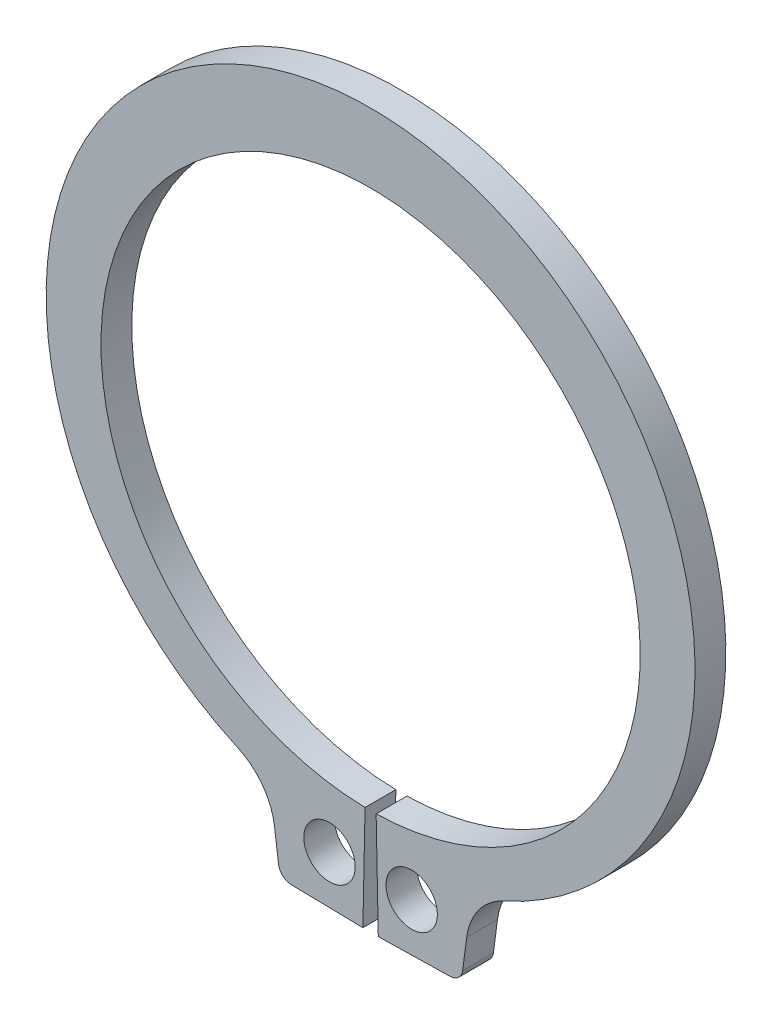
ISO-10303-21;
HEADER;
FILE_DESCRIPTION(('STEP AP214'),'2;1');
FILE_NAME('part.step','',(''),(''),'','','');
FILE_SCHEMA(('AUTOMOTIVE_DESIGN { 1 0 10303 214 1 1 1 1 }'));
ENDSEC;
DATA;
#1=APPLICATION_CONTEXT('core data for automotive mechanical design processes');
#2=APPLICATION_PROTOCOL_DEFINITION('international standard','automotive_design',2000,#1);
#3=PRODUCT_CONTEXT('',#1,'mechanical');
#4=PRODUCT('Part','Part','',(#3));
#5=PRODUCT_RELATED_PRODUCT_CATEGORY('part','',(#4));
#6=PRODUCT_DEFINITION_FORMATION('','',#4);
#7=PRODUCT_DEFINITION_CONTEXT('part definition',#1,'design');
#8=PRODUCT_DEFINITION('design','',#6,#7);
#9=PRODUCT_DEFINITION_SHAPE('','',#8);
#10=(LENGTH_UNIT() NAMED_UNIT(*) SI_UNIT(.MILLI.,.METRE.));
#11=(NAMED_UNIT(*) PLANE_ANGLE_UNIT() SI_UNIT($,.RADIAN.));
#12=(NAMED_UNIT(*) SI_UNIT($,.STERADIAN.) SOLID_ANGLE_UNIT());
#13=UNCERTAINTY_MEASURE_WITH_UNIT(LENGTH_MEASURE(1.E-05),#10,'distance_accuracy_value','');
#14=(GEOMETRIC_REPRESENTATION_CONTEXT(3) GLOBAL_UNCERTAINTY_ASSIGNED_CONTEXT((#13)) GLOBAL_UNIT_ASSIGNED_CONTEXT((#10,
#11,#12)) REPRESENTATION_CONTEXT('',''));
#15=CARTESIAN_POINT('',(0.,0.,0.));
#16=DIRECTION('',(0.,0.,1.));
#17=DIRECTION('',(1.,0.,0.));
#18=AXIS2_PLACEMENT_3D('',#15,#16,#17);
#19=CARTESIAN_POINT('',(0.,0.,-1.2));
#20=DIRECTION('',(0.,0.,1.));
#21=DIRECTION('',(1.,0.,0.));
#22=AXIS2_PLACEMENT_3D('',#19,#20,#21);
#23=CYLINDRICAL_SURFACE('',#22,10.5);
#24=CARTESIAN_POINT('',(0.,0.,0.));
#25=DIRECTION('',(0.,0.,-1.));
#26=DIRECTION('',(1.,0.,0.));
#27=AXIS2_PLACEMENT_3D('',#24,#25,#26);
#28=CIRCLE('',#27,10.5);
#29=CARTESIAN_POINT('',(-0.215753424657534,-10.4977831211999,0.));
#30=VERTEX_POINT('',#29);
#31=CARTESIAN_POINT('',(0.215753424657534,-10.4977831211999,0.));
#32=VERTEX_POINT('',#31);
#33=EDGE_CURVE('E151',#30,#32,#28,.T.);
#34=ORIENTED_EDGE('',*,*,#33,.F.);
#35=DIRECTION('',(0.,0.,1.));
#36=VECTOR('',#35,1.);
#37=CARTESIAN_POINT('',(-0.215753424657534,-10.4977831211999,-1.2));
#38=LINE('',#37,#36);
#39=CARTESIAN_POINT('',(-0.215753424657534,-10.4977831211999,-1.2));
#40=VERTEX_POINT('',#39);
#41=EDGE_CURVE('E11',#40,#30,#38,.T.);
#42=ORIENTED_EDGE('',*,*,#41,.F.);
#43=CARTESIAN_POINT('',(0.,0.,-1.2));
#44=DIRECTION('',(0.,0.,-1.));
#45=DIRECTION('',(1.,0.,0.));
#46=AXIS2_PLACEMENT_3D('',#43,#44,#45);
#47=CIRCLE('',#46,10.5);
#48=CARTESIAN_POINT('',(0.215753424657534,-10.4977831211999,-1.2));
#49=VERTEX_POINT('',#48);
#50=EDGE_CURVE('E184',#40,#49,#47,.T.);
#51=ORIENTED_EDGE('',*,*,#50,.T.);
#52=DIRECTION('',(0.,0.,1.));
#53=VECTOR('',#52,1.);
#54=CARTESIAN_POINT('',(0.215753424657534,-10.4977831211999,-1.2));
#55=LINE('',#54,#53);
#56=EDGE_CURVE('E33',#49,#32,#55,.T.);
#57=ORIENTED_EDGE('',*,*,#56,.T.);
#58=EDGE_LOOP('',(#34,#42,#51,#57));
#59=FACE_BOUND('',#58,.T.);
#60=ADVANCED_FACE('F30',(#59),#23,.F.);
#61=CARTESIAN_POINT('',(-0.215753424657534,-10.4977831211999,-1.2));
#62=DIRECTION('',(0.9997888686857,-0.0205479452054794,0.));
#63=DIRECTION('',(0.0205479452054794,0.9997888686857,0.));
#64=AXIS2_PLACEMENT_3D('',#61,#62,#63);
#65=PLANE('',#64);
#66=DIRECTION('',(0.0205479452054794,0.9997888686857,0.));
#67=VECTOR('',#66,1.);
#68=CARTESIAN_POINT('',(-0.215753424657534,-10.4977831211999,0.));
#69=LINE('',#68,#67);
#70=CARTESIAN_POINT('',(-0.3,-14.5969174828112,0.));
#71=VERTEX_POINT('',#70);
#72=EDGE_CURVE('E182',#71,#30,#69,.T.);
#73=ORIENTED_EDGE('',*,*,#72,.F.);
#74=DIRECTION('',(0.,0.,1.));
#75=VECTOR('',#74,1.);
#76=CARTESIAN_POINT('',(-0.3,-14.5969174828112,-1.2));
#77=LINE('',#76,#75);
#78=CARTESIAN_POINT('',(-0.3,-14.5969174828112,-1.2));
#79=VERTEX_POINT('',#78);
#80=EDGE_CURVE('E39',#79,#71,#77,.T.);
#81=ORIENTED_EDGE('',*,*,#80,.F.);
#82=DIRECTION('',(0.0205479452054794,0.9997888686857,0.));
#83=VECTOR('',#82,1.);
#84=CARTESIAN_POINT('',(-0.215753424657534,-10.4977831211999,-1.2));
#85=LINE('',#84,#83);
#86=EDGE_CURVE('E141',#79,#40,#85,.T.);
#87=ORIENTED_EDGE('',*,*,#86,.T.);
#88=ORIENTED_EDGE('',*,*,#41,.T.);
#89=EDGE_LOOP('',(#73,#81,#87,#88));
#90=FACE_BOUND('',#89,.T.);
#91=ADVANCED_FACE('F204',(#90),#65,.T.);
#92=CARTESIAN_POINT('',(-0.3,-14.5969174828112,-1.2));
#93=DIRECTION('',(-0.0205479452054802,-0.9997888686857,0.));
#94=DIRECTION('',(0.9997888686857,-0.0205479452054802,0.));
#95=AXIS2_PLACEMENT_3D('',#92,#93,#94);
#96=PLANE('',#95);
#97=DIRECTION('',(0.9997888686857,-0.0205479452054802,0.));
#98=VECTOR('',#97,1.);
#99=CARTESIAN_POINT('',(-0.3,-14.5969174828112,0.));
#100=LINE('',#99,#98);
#101=CARTESIAN_POINT('',(-3.09759495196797,-14.5394205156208,0.));
#102=VERTEX_POINT('',#101);
#103=EDGE_CURVE('E128',#102,#71,#100,.T.);
#104=ORIENTED_EDGE('',*,*,#103,.F.);
#105=DIRECTION('',(0.,0.,1.));
#106=VECTOR('',#105,1.);
#107=CARTESIAN_POINT('',(-3.09759495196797,-14.5394205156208,-1.2));
#108=LINE('',#107,#106);
#109=CARTESIAN_POINT('',(-3.09759495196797,-14.5394205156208,-1.2));
#110=VERTEX_POINT('',#109);
#111=EDGE_CURVE('E123',#110,#102,#108,.T.);
#112=ORIENTED_EDGE('',*,*,#111,.F.);
#113=DIRECTION('',(0.9997888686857,-0.0205479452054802,0.));
#114=VECTOR('',#113,1.);
#115=CARTESIAN_POINT('',(-0.3,-14.5969174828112,-1.2));
#116=LINE('',#115,#114);
#117=EDGE_CURVE('E126',#110,#79,#116,.T.);
#118=ORIENTED_EDGE('',*,*,#117,.T.);
#119=ORIENTED_EDGE('',*,*,#80,.T.);
#120=EDGE_LOOP('',(#104,#112,#118,#119));
#121=FACE_BOUND('',#120,.T.);
#122=ADVANCED_FACE('F125',(#121),#96,.T.);
#123=CARTESIAN_POINT('',(-3.08732097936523,-14.039526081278,-1.2));
#124=DIRECTION('',(0.,0.,1.));
#125=DIRECTION('',(1.,0.,0.));
#126=AXIS2_PLACEMENT_3D('',#123,#124,#125);
#127=CYLINDRICAL_SURFACE('',#126,0.5);
#128=CARTESIAN_POINT('',(-3.08732097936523,-14.039526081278,0.));
#129=DIRECTION('',(0.,0.,1.));
#130=DIRECTION('',(1.,0.,0.));
#131=AXIS2_PLACEMENT_3D('',#128,#129,#130);
#132=CIRCLE('',#131,0.5);
#133=CARTESIAN_POINT('',(-3.58304341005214,-14.104789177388,0.));
#134=VERTEX_POINT('',#133);
#135=EDGE_CURVE('E179',#134,#102,#132,.T.);
#136=ORIENTED_EDGE('',*,*,#135,.F.);
#137=DIRECTION('',(0.,0.,1.));
#138=VECTOR('',#137,1.);
#139=CARTESIAN_POINT('',(-3.58304341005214,-14.104789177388,-1.2));
#140=LINE('',#139,#138);
#141=CARTESIAN_POINT('',(-3.58304341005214,-14.104789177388,-1.2));
#142=VERTEX_POINT('',#141);
#143=EDGE_CURVE('E133',#142,#134,#140,.T.);
#144=ORIENTED_EDGE('',*,*,#143,.F.);
#145=CARTESIAN_POINT('',(-3.08732097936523,-14.039526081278,-1.2));
#146=DIRECTION('',(0.,0.,1.));
#147=DIRECTION('',(1.,0.,0.));
#148=AXIS2_PLACEMENT_3D('',#145,#146,#147);
#149=CIRCLE('',#148,0.5);
#150=EDGE_CURVE('E139',#142,#110,#149,.T.);
#151=ORIENTED_EDGE('',*,*,#150,.T.);
#152=ORIENTED_EDGE('',*,*,#111,.T.);
#153=EDGE_LOOP('',(#136,#144,#151,#152));
#154=FACE_BOUND('',#153,.T.);
#155=ADVANCED_FACE('F143',(#154),#127,.T.);
#156=CARTESIAN_POINT('',(-3.74243131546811,-12.894117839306,-1.2));
#157=DIRECTION('',(-0.99144486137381,-0.130526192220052,0.));
#158=DIRECTION('',(0.130526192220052,-0.99144486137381,0.));
#159=AXIS2_PLACEMENT_3D('',#156,#157,#158);
#160=PLANE('',#159);
#161=DIRECTION('',(0.130526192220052,-0.99144486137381,0.));
#162=VECTOR('',#161,1.);
#163=CARTESIAN_POINT('',(-3.74243131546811,-12.894117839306,0.));
#164=LINE('',#163,#162);
#165=CARTESIAN_POINT('',(-3.74243131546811,-12.894117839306,0.));
#166=VERTEX_POINT('',#165);
#167=EDGE_CURVE('E176',#166,#134,#164,.T.);
#168=ORIENTED_EDGE('',*,*,#167,.F.);
#169=DIRECTION('',(0.,0.,1.));
#170=VECTOR('',#169,1.);
#171=CARTESIAN_POINT('',(-3.74243131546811,-12.894117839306,-1.2));
#172=LINE('',#171,#170);
#173=CARTESIAN_POINT('',(-3.74243131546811,-12.894117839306,-1.2));
#174=VERTEX_POINT('',#173);
#175=EDGE_CURVE('E188',#174,#166,#172,.T.);
#176=ORIENTED_EDGE('',*,*,#175,.F.);
#177=DIRECTION('',(0.130526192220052,-0.99144486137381,0.));
#178=VECTOR('',#177,1.);
#179=CARTESIAN_POINT('',(-3.74243131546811,-12.894117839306,-1.2));
#180=LINE('',#179,#178);
#181=EDGE_CURVE('E144',#174,#142,#180,.T.);
#182=ORIENTED_EDGE('',*,*,#181,.T.);
#183=ORIENTED_EDGE('',*,*,#143,.T.);
#184=EDGE_LOOP('',(#168,#176,#182,#183));
#185=FACE_BOUND('',#184,.T.);
#186=ADVANCED_FACE('F217',(#185),#160,.T.);
#187=CARTESIAN_POINT('',(-6.20084298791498,-13.2177738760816,-1.2));
#188=DIRECTION('',(0.,0.,1.));
#189=DIRECTION('',(1.,0.,0.));
#190=AXIS2_PLACEMENT_3D('',#187,#188,#189);
#191=CYLINDRICAL_SURFACE('',#190,2.4796252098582);
#192=CARTESIAN_POINT('',(-6.20084298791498,-13.2177738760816,0.));
#193=DIRECTION('',(0.,0.,-1.));
#194=DIRECTION('',(1.,0.,0.));
#195=AXIS2_PLACEMENT_3D('',#192,#193,#194);
#196=CIRCLE('',#195,2.4796252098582);
#197=CARTESIAN_POINT('',(-5.18352298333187,-10.9564465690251,0.));
#198=VERTEX_POINT('',#197);
#199=EDGE_CURVE('E173',#198,#166,#196,.T.);
#200=ORIENTED_EDGE('',*,*,#199,.F.);
#201=DIRECTION('',(0.,0.,1.));
#202=VECTOR('',#201,1.);
#203=CARTESIAN_POINT('',(-5.18352298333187,-10.9564465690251,-1.2));
#204=LINE('',#203,#202);
#205=CARTESIAN_POINT('',(-5.18352298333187,-10.9564465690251,-1.2));
#206=VERTEX_POINT('',#205);
#207=EDGE_CURVE('E190',#206,#198,#204,.T.);
#208=ORIENTED_EDGE('',*,*,#207,.F.);
#209=CARTESIAN_POINT('',(-6.20084298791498,-13.2177738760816,-1.2));
#210=DIRECTION('',(0.,0.,-1.));
#211=DIRECTION('',(1.,0.,0.));
#212=AXIS2_PLACEMENT_3D('',#209,#210,#211);
#213=CIRCLE('',#212,2.4796252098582);
#214=EDGE_CURVE('E146',#206,#174,#213,.T.);
#215=ORIENTED_EDGE('',*,*,#214,.T.);
#216=ORIENTED_EDGE('',*,*,#175,.T.);
#217=EDGE_LOOP('',(#200,#208,#215,#216));
#218=FACE_BOUND('',#217,.T.);
#219=ADVANCED_FACE('F220',(#218),#191,.F.);
#220=CARTESIAN_POINT('',(0.,0.565633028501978,-1.2));
#221=DIRECTION('',(0.,0.,1.));
#222=DIRECTION('',(1.,0.,0.));
#223=AXIS2_PLACEMENT_3D('',#220,#221,#222);
#224=CYLINDRICAL_SURFACE('',#223,12.634366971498);
#225=CARTESIAN_POINT('',(0.,0.565633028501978,0.));
#226=DIRECTION('',(0.,0.,1.));
#227=DIRECTION('',(1.,0.,0.));
#228=AXIS2_PLACEMENT_3D('',#225,#226,#227);
#229=CIRCLE('',#228,12.634366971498);
#230=CARTESIAN_POINT('',(5.18352298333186,-10.9564465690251,0.));
#231=VERTEX_POINT('',#230);
#232=EDGE_CURVE('E170',#231,#198,#229,.T.);
#233=ORIENTED_EDGE('',*,*,#232,.F.);
#234=DIRECTION('',(0.,0.,1.));
#235=VECTOR('',#234,1.);
#236=CARTESIAN_POINT('',(5.18352298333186,-10.9564465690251,-1.2));
#237=LINE('',#236,#235);
#238=CARTESIAN_POINT('',(5.18352298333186,-10.9564465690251,-1.2));
#239=VERTEX_POINT('',#238);
#240=EDGE_CURVE('E192',#239,#231,#237,.T.);
#241=ORIENTED_EDGE('',*,*,#240,.F.);
#242=CARTESIAN_POINT('',(0.,0.565633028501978,-1.2));
#243=DIRECTION('',(0.,0.,1.));
#244=DIRECTION('',(1.,0.,0.));
#245=AXIS2_PLACEMENT_3D('',#242,#243,#244);
#246=CIRCLE('',#245,12.634366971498);
#247=EDGE_CURVE('E294',#239,#206,#246,.T.);
#248=ORIENTED_EDGE('',*,*,#247,.T.);
#249=ORIENTED_EDGE('',*,*,#207,.T.);
#250=EDGE_LOOP('',(#233,#241,#248,#249));
#251=FACE_BOUND('',#250,.T.);
#252=ADVANCED_FACE('F224',(#251),#224,.T.);
#253=CARTESIAN_POINT('',(6.20084298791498,-13.2177738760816,-1.2));
#254=DIRECTION('',(0.,0.,1.));
#255=DIRECTION('',(1.,0.,0.));
#256=AXIS2_PLACEMENT_3D('',#253,#254,#255);
#257=CYLINDRICAL_SURFACE('',#256,2.4796252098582);
#258=CARTESIAN_POINT('',(6.20084298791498,-13.2177738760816,0.));
#259=DIRECTION('',(0.,0.,-1.));
#260=DIRECTION('',(1.,0.,0.));
#261=AXIS2_PLACEMENT_3D('',#258,#259,#260);
#262=CIRCLE('',#261,2.4796252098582);
#263=CARTESIAN_POINT('',(3.74243131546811,-12.894117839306,0.));
#264=VERTEX_POINT('',#263);
#265=EDGE_CURVE('E167',#264,#231,#262,.T.);
#266=ORIENTED_EDGE('',*,*,#265,.F.);
#267=DIRECTION('',(0.,0.,1.));
#268=VECTOR('',#267,1.);
#269=CARTESIAN_POINT('',(3.74243131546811,-12.894117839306,-1.2));
#270=LINE('',#269,#268);
#271=CARTESIAN_POINT('',(3.74243131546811,-12.894117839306,-1.2));
#272=VERTEX_POINT('',#271);
#273=EDGE_CURVE('E194',#272,#264,#270,.T.);
#274=ORIENTED_EDGE('',*,*,#273,.F.);
#275=CARTESIAN_POINT('',(6.20084298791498,-13.2177738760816,-1.2));
#276=DIRECTION('',(0.,0.,-1.));
#277=DIRECTION('',(1.,0.,0.));
#278=AXIS2_PLACEMENT_3D('',#275,#276,#277);
#279=CIRCLE('',#278,2.4796252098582);
#280=EDGE_CURVE('E291',#272,#239,#279,.T.);
#281=ORIENTED_EDGE('',*,*,#280,.T.);
#282=ORIENTED_EDGE('',*,*,#240,.T.);
#283=EDGE_LOOP('',(#266,#274,#281,#282));
#284=FACE_BOUND('',#283,.T.);
#285=ADVANCED_FACE('F228',(#284),#257,.F.);
#286=CARTESIAN_POINT('',(3.74243131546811,-12.894117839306,-1.2));
#287=DIRECTION('',(0.99144486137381,-0.130526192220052,0.));
#288=DIRECTION('',(0.130526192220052,0.99144486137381,0.));
#289=AXIS2_PLACEMENT_3D('',#286,#287,#288);
#290=PLANE('',#289);
#291=DIRECTION('',(0.130526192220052,0.99144486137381,0.));
#292=VECTOR('',#291,1.);
#293=CARTESIAN_POINT('',(3.74243131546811,-12.894117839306,0.));
#294=LINE('',#293,#292);
#295=CARTESIAN_POINT('',(3.58304341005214,-14.104789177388,0.));
#296=VERTEX_POINT('',#295);
#297=EDGE_CURVE('E164',#296,#264,#294,.T.);
#298=ORIENTED_EDGE('',*,*,#297,.F.);
#299=DIRECTION('',(0.,0.,1.));
#300=VECTOR('',#299,1.);
#301=CARTESIAN_POINT('',(3.58304341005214,-14.104789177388,-1.2));
#302=LINE('',#301,#300);
#303=CARTESIAN_POINT('',(3.58304341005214,-14.104789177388,-1.2));
#304=VERTEX_POINT('',#303);
#305=EDGE_CURVE('E196',#304,#296,#302,.T.);
#306=ORIENTED_EDGE('',*,*,#305,.F.);
#307=DIRECTION('',(0.130526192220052,0.99144486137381,0.));
#308=VECTOR('',#307,1.);
#309=CARTESIAN_POINT('',(3.74243131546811,-12.894117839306,-1.2));
#310=LINE('',#309,#308);
#311=EDGE_CURVE('E288',#304,#272,#310,.T.);
#312=ORIENTED_EDGE('',*,*,#311,.T.);
#313=ORIENTED_EDGE('',*,*,#273,.T.);
#314=EDGE_LOOP('',(#298,#306,#312,#313));
#315=FACE_BOUND('',#314,.T.);
#316=ADVANCED_FACE('F232',(#315),#290,.T.);
#317=CARTESIAN_POINT('',(3.08732097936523,-14.039526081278,-1.2));
#318=DIRECTION('',(0.,0.,1.));
#319=DIRECTION('',(1.,0.,0.));
#320=AXIS2_PLACEMENT_3D('',#317,#318,#319);
#321=CYLINDRICAL_SURFACE('',#320,0.5);
#322=CARTESIAN_POINT('',(3.08732097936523,-14.039526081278,0.));
#323=DIRECTION('',(0.,0.,1.));
#324=DIRECTION('',(-1.,0.,0.));
#325=AXIS2_PLACEMENT_3D('',#322,#323,#324);
#326=CIRCLE('',#325,0.5);
#327=CARTESIAN_POINT('',(3.09759495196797,-14.5394205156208,0.));
#328=VERTEX_POINT('',#327);
#329=EDGE_CURVE('E161',#328,#296,#326,.T.);
#330=ORIENTED_EDGE('',*,*,#329,.F.);
#331=DIRECTION('',(0.,0.,1.));
#332=VECTOR('',#331,1.);
#333=CARTESIAN_POINT('',(3.09759495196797,-14.5394205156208,-1.2));
#334=LINE('',#333,#332);
#335=CARTESIAN_POINT('',(3.09759495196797,-14.5394205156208,-1.2));
#336=VERTEX_POINT('',#335);
#337=EDGE_CURVE('E198',#336,#328,#334,.T.);
#338=ORIENTED_EDGE('',*,*,#337,.F.);
#339=CARTESIAN_POINT('',(3.08732097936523,-14.039526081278,-1.2));
#340=DIRECTION('',(0.,0.,1.));
#341=DIRECTION('',(-1.,0.,0.));
#342=AXIS2_PLACEMENT_3D('',#339,#340,#341);
#343=CIRCLE('',#342,0.5);
#344=EDGE_CURVE('E285',#336,#304,#343,.T.);
#345=ORIENTED_EDGE('',*,*,#344,.T.);
#346=ORIENTED_EDGE('',*,*,#305,.T.);
#347=EDGE_LOOP('',(#330,#338,#345,#346));
#348=FACE_BOUND('',#347,.T.);
#349=ADVANCED_FACE('F236',(#348),#321,.T.);
#350=CARTESIAN_POINT('',(0.3,-14.5969174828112,-1.2));
#351=DIRECTION('',(0.0205479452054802,-0.9997888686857,0.));
#352=DIRECTION('',(0.9997888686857,0.0205479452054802,0.));
#353=AXIS2_PLACEMENT_3D('',#350,#351,#352);
#354=PLANE('',#353);
#355=DIRECTION('',(0.9997888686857,0.0205479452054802,0.));
#356=VECTOR('',#355,1.);
#357=CARTESIAN_POINT('',(0.3,-14.5969174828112,0.));
#358=LINE('',#357,#356);
#359=CARTESIAN_POINT('',(0.3,-14.5969174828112,0.));
#360=VERTEX_POINT('',#359);
#361=EDGE_CURVE('E158',#360,#328,#358,.T.);
#362=ORIENTED_EDGE('',*,*,#361,.F.);
#363=DIRECTION('',(0.,0.,1.));
#364=VECTOR('',#363,1.);
#365=CARTESIAN_POINT('',(0.3,-14.5969174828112,-1.2));
#366=LINE('',#365,#364);
#367=CARTESIAN_POINT('',(0.3,-14.5969174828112,-1.2));
#368=VERTEX_POINT('',#367);
#369=EDGE_CURVE('E199',#368,#360,#366,.T.);
#370=ORIENTED_EDGE('',*,*,#369,.F.);
#371=DIRECTION('',(0.9997888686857,0.0205479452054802,0.));
#372=VECTOR('',#371,1.);
#373=CARTESIAN_POINT('',(0.3,-14.5969174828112,-1.2));
#374=LINE('',#373,#372);
#375=EDGE_CURVE('E282',#368,#336,#374,.T.);
#376=ORIENTED_EDGE('',*,*,#375,.T.);
#377=ORIENTED_EDGE('',*,*,#337,.T.);
#378=EDGE_LOOP('',(#362,#370,#376,#377));
#379=FACE_BOUND('',#378,.T.);
#380=ADVANCED_FACE('F240',(#379),#354,.T.);
#381=CARTESIAN_POINT('',(0.215753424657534,-10.4977831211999,-1.2));
#382=DIRECTION('',(-0.9997888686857,-0.0205479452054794,0.));
#383=DIRECTION('',(0.0205479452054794,-0.9997888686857,0.));
#384=AXIS2_PLACEMENT_3D('',#381,#382,#383);
#385=PLANE('',#384);
#386=DIRECTION('',(0.0205479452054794,-0.9997888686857,0.));
#387=VECTOR('',#386,1.);
#388=CARTESIAN_POINT('',(0.215753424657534,-10.4977831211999,0.));
#389=LINE('',#388,#387);
#390=EDGE_CURVE('E154',#32,#360,#389,.T.);
#391=ORIENTED_EDGE('',*,*,#390,.F.);
#392=ORIENTED_EDGE('',*,*,#56,.F.);
#393=DIRECTION('',(0.0205479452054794,-0.9997888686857,0.));
#394=VECTOR('',#393,1.);
#395=CARTESIAN_POINT('',(0.215753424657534,-10.4977831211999,-1.2));
#396=LINE('',#395,#394);
#397=EDGE_CURVE('E280',#49,#368,#396,.T.);
#398=ORIENTED_EDGE('',*,*,#397,.T.);
#399=ORIENTED_EDGE('',*,*,#369,.T.);
#400=EDGE_LOOP('',(#391,#392,#398,#399));
#401=FACE_BOUND('',#400,.T.);
#402=ADVANCED_FACE('F201',(#401),#385,.T.);
#403=CARTESIAN_POINT('',(0.,0.,-1.2));
#404=DIRECTION('',(0.,0.,1.));
#405=DIRECTION('',(1.,0.,0.));
#406=AXIS2_PLACEMENT_3D('',#403,#404,#405);
#407=PLANE('',#406);
#408=CARTESIAN_POINT('',(-1.6,-12.69960629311,-1.2));
#409=DIRECTION('',(0.,0.,1.));
#410=DIRECTION('',(1.,0.,0.));
#411=AXIS2_PLACEMENT_3D('',#408,#409,#410);
#412=CIRCLE('',#411,1.);
#413=CARTESIAN_POINT('',(-0.6,-12.69960629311,-1.2));
#414=VERTEX_POINT('',#413);
#415=EDGE_CURVE('E267',#414,#414,#412,.T.);
#416=ORIENTED_EDGE('',*,*,#415,.T.);
#417=EDGE_LOOP('',(#416));
#418=FACE_BOUND('',#417,.T.);
#419=CARTESIAN_POINT('',(1.6,-12.69960629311,-1.2));
#420=DIRECTION('',(0.,0.,1.));
#421=DIRECTION('',(1.,0.,0.));
#422=AXIS2_PLACEMENT_3D('',#419,#420,#421);
#423=CIRCLE('',#422,1.);
#424=CARTESIAN_POINT('',(2.6,-12.69960629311,-1.2));
#425=VERTEX_POINT('',#424);
#426=EDGE_CURVE('E155',#425,#425,#423,.T.);
#427=ORIENTED_EDGE('',*,*,#426,.T.);
#428=EDGE_LOOP('',(#427));
#429=FACE_BOUND('',#428,.T.);
#430=ORIENTED_EDGE('',*,*,#50,.F.);
#431=ORIENTED_EDGE('',*,*,#86,.F.);
#432=ORIENTED_EDGE('',*,*,#117,.F.);
#433=ORIENTED_EDGE('',*,*,#150,.F.);
#434=ORIENTED_EDGE('',*,*,#181,.F.);
#435=ORIENTED_EDGE('',*,*,#214,.F.);
#436=ORIENTED_EDGE('',*,*,#247,.F.);
#437=ORIENTED_EDGE('',*,*,#280,.F.);
#438=ORIENTED_EDGE('',*,*,#311,.F.);
#439=ORIENTED_EDGE('',*,*,#344,.F.);
#440=ORIENTED_EDGE('',*,*,#375,.F.);
#441=ORIENTED_EDGE('',*,*,#397,.F.);
#442=EDGE_LOOP('',(#430,#431,#432,#433,#434,#435,#436,#437,#438,#439,#440,#441));
#443=FACE_BOUND('',#442,.T.);
#444=ADVANCED_FACE('F137',(#418,#429,#443),#407,.F.);
#445=CARTESIAN_POINT('',(0.,0.,0.));
#446=DIRECTION('',(0.,0.,1.));
#447=DIRECTION('',(1.,0.,0.));
#448=AXIS2_PLACEMENT_3D('',#445,#446,#447);
#449=PLANE('',#448);
#450=CARTESIAN_POINT('',(-1.6,-12.69960629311,0.));
#451=DIRECTION('',(0.,0.,1.));
#452=DIRECTION('',(1.,0.,0.));
#453=AXIS2_PLACEMENT_3D('',#450,#451,#452);
#454=CIRCLE('',#453,1.);
#455=CARTESIAN_POINT('',(-0.6,-12.69960629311,0.));
#456=VERTEX_POINT('',#455);
#457=EDGE_CURVE('E270',#456,#456,#454,.T.);
#458=ORIENTED_EDGE('',*,*,#457,.F.);
#459=EDGE_LOOP('',(#458));
#460=FACE_BOUND('',#459,.T.);
#461=CARTESIAN_POINT('',(1.6,-12.69960629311,0.));
#462=DIRECTION('',(0.,0.,1.));
#463=DIRECTION('',(1.,0.,0.));
#464=AXIS2_PLACEMENT_3D('',#461,#462,#463);
#465=CIRCLE('',#464,1.);
#466=CARTESIAN_POINT('',(2.6,-12.69960629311,0.));
#467=VERTEX_POINT('',#466);
#468=EDGE_CURVE('E272',#467,#467,#465,.T.);
#469=ORIENTED_EDGE('',*,*,#468,.F.);
#470=EDGE_LOOP('',(#469));
#471=FACE_BOUND('',#470,.T.);
#472=ORIENTED_EDGE('',*,*,#33,.T.);
#473=ORIENTED_EDGE('',*,*,#390,.T.);
#474=ORIENTED_EDGE('',*,*,#361,.T.);
#475=ORIENTED_EDGE('',*,*,#329,.T.);
#476=ORIENTED_EDGE('',*,*,#297,.T.);
#477=ORIENTED_EDGE('',*,*,#265,.T.);
#478=ORIENTED_EDGE('',*,*,#232,.T.);
#479=ORIENTED_EDGE('',*,*,#199,.T.);
#480=ORIENTED_EDGE('',*,*,#167,.T.);
#481=ORIENTED_EDGE('',*,*,#135,.T.);
#482=ORIENTED_EDGE('',*,*,#103,.T.);
#483=ORIENTED_EDGE('',*,*,#72,.T.);
#484=EDGE_LOOP('',(#472,#473,#474,#475,#476,#477,#478,#479,#480,#481,#482,#483));
#485=FACE_BOUND('',#484,.T.);
#486=ADVANCED_FACE('F203',(#460,#471,#485),#449,.T.);
#487=CARTESIAN_POINT('',(1.6,-12.69960629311,-1.2));
#488=DIRECTION('',(0.,0.,1.));
#489=DIRECTION('',(1.,0.,0.));
#490=AXIS2_PLACEMENT_3D('',#487,#488,#489);
#491=CYLINDRICAL_SURFACE('',#490,1.);
#492=ORIENTED_EDGE('',*,*,#426,.F.);
#493=EDGE_LOOP('',(#492));
#494=FACE_BOUND('',#493,.T.);
#495=ORIENTED_EDGE('',*,*,#468,.T.);
#496=EDGE_LOOP('',(#495));
#497=FACE_BOUND('',#496,.T.);
#498=ADVANCED_FACE('F252',(#494,#497),#491,.F.);
#499=CARTESIAN_POINT('',(-1.6,-12.69960629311,-1.2));
#500=DIRECTION('',(0.,0.,1.));
#501=DIRECTION('',(1.,0.,0.));
#502=AXIS2_PLACEMENT_3D('',#499,#500,#501);
#503=CYLINDRICAL_SURFACE('',#502,1.);
#504=ORIENTED_EDGE('',*,*,#415,.F.);
#505=EDGE_LOOP('',(#504));
#506=FACE_BOUND('',#505,.T.);
#507=ORIENTED_EDGE('',*,*,#457,.T.);
#508=EDGE_LOOP('',(#507));
#509=FACE_BOUND('',#508,.T.);
#510=ADVANCED_FACE('F259',(#506,#509),#503,.F.);
#511=CLOSED_SHELL('',(#60,#91,#122,#155,#186,#219,#252,#285,#316,#349,#380,#402,#444,#486,#498,#510));
#512=MANIFOLD_SOLID_BREP('B2',#511);
#513=ADVANCED_BREP_SHAPE_REPRESENTATION('',(#18,#512),#14);
#514=SHAPE_DEFINITION_REPRESENTATION(#9,#513);
ENDSEC;
END-ISO-10303-21;
